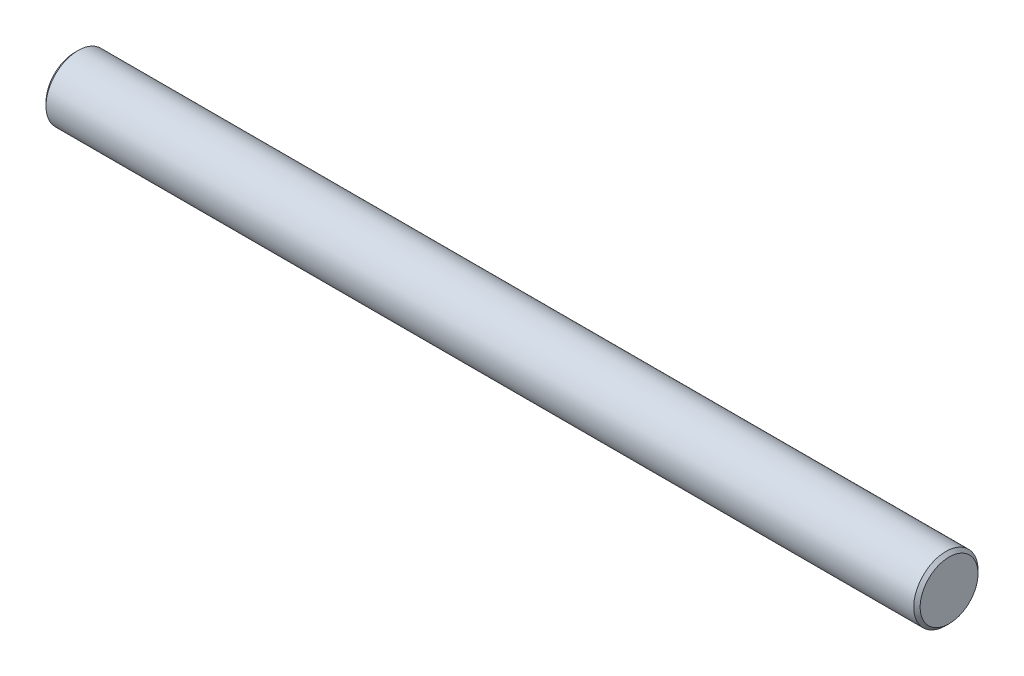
ISO-10303-21;
HEADER;
FILE_DESCRIPTION(('STEP AP214'),'2;1');
FILE_NAME('part.step','',(''),(''),'','','');
FILE_SCHEMA(('AUTOMOTIVE_DESIGN { 1 0 10303 214 1 1 1 1 }'));
ENDSEC;
DATA;
#1=APPLICATION_CONTEXT('core data for automotive mechanical design processes');
#2=APPLICATION_PROTOCOL_DEFINITION('international standard','automotive_design',2000,#1);
#3=PRODUCT_CONTEXT('',#1,'mechanical');
#4=PRODUCT('Part','Part','',(#3));
#5=PRODUCT_RELATED_PRODUCT_CATEGORY('part','',(#4));
#6=PRODUCT_DEFINITION_FORMATION('','',#4);
#7=PRODUCT_DEFINITION_CONTEXT('part definition',#1,'design');
#8=PRODUCT_DEFINITION('design','',#6,#7);
#9=PRODUCT_DEFINITION_SHAPE('','',#8);
#10=(LENGTH_UNIT() NAMED_UNIT(*) SI_UNIT(.MILLI.,.METRE.));
#11=(NAMED_UNIT(*) PLANE_ANGLE_UNIT() SI_UNIT($,.RADIAN.));
#12=(NAMED_UNIT(*) SI_UNIT($,.STERADIAN.) SOLID_ANGLE_UNIT());
#13=UNCERTAINTY_MEASURE_WITH_UNIT(LENGTH_MEASURE(1.E-05),#10,'distance_accuracy_value','');
#14=(GEOMETRIC_REPRESENTATION_CONTEXT(3) GLOBAL_UNCERTAINTY_ASSIGNED_CONTEXT((#13)) GLOBAL_UNIT_ASSIGNED_CONTEXT((#10,
#11,#12)) REPRESENTATION_CONTEXT('',''));
#15=CARTESIAN_POINT('',(0.,0.,0.));
#16=DIRECTION('',(0.,0.,1.));
#17=DIRECTION('',(1.,0.,0.));
#18=AXIS2_PLACEMENT_3D('',#15,#16,#17);
#19=CARTESIAN_POINT('',(272.,0.,0.));
#20=DIRECTION('',(-1.,0.,0.));
#21=DIRECTION('',(0.,0.,1.));
#22=AXIS2_PLACEMENT_3D('',#19,#20,#21);
#23=CYLINDRICAL_SURFACE('',#22,10.);
#24=CARTESIAN_POINT('',(271.,0.,0.));
#25=DIRECTION('',(1.,0.,0.));
#26=DIRECTION('',(0.,0.,-1.));
#27=AXIS2_PLACEMENT_3D('',#24,#25,#26);
#28=CIRCLE('',#27,10.);
#29=CARTESIAN_POINT('',(271.,0.,-10.));
#30=VERTEX_POINT('',#29);
#31=EDGE_CURVE('E9178',#30,#30,#28,.F.);
#32=ORIENTED_EDGE('',*,*,#31,.T.);
#33=EDGE_LOOP('',(#32));
#34=FACE_BOUND('',#33,.T.);
#35=CARTESIAN_POINT('',(1.,0.,0.));
#36=DIRECTION('',(1.,0.,0.));
#37=DIRECTION('',(0.,0.,-1.));
#38=AXIS2_PLACEMENT_3D('',#35,#36,#37);
#39=CIRCLE('',#38,10.);
#40=CARTESIAN_POINT('',(1.,0.,-10.));
#41=VERTEX_POINT('',#40);
#42=EDGE_CURVE('E9182',#41,#41,#39,.T.);
#43=ORIENTED_EDGE('',*,*,#42,.T.);
#44=EDGE_LOOP('',(#43));
#45=FACE_BOUND('',#44,.T.);
#46=ADVANCED_FACE('F9172',(#34,#45),#23,.T.);
#47=CARTESIAN_POINT('',(272.,0.,0.));
#48=DIRECTION('',(1.,0.,0.));
#49=DIRECTION('',(0.,0.,-1.));
#50=AXIS2_PLACEMENT_3D('',#47,#48,#49);
#51=PLANE('',#50);
#52=CARTESIAN_POINT('',(272.,0.,0.));
#53=DIRECTION('',(1.,0.,0.));
#54=DIRECTION('',(0.,0.,-1.));
#55=AXIS2_PLACEMENT_3D('',#52,#53,#54);
#56=CIRCLE('',#55,9.);
#57=CARTESIAN_POINT('',(272.,0.,-9.));
#58=VERTEX_POINT('',#57);
#59=EDGE_CURVE('E9186',#58,#58,#56,.T.);
#60=ORIENTED_EDGE('',*,*,#59,.T.);
#61=EDGE_LOOP('',(#60));
#62=FACE_BOUND('',#61,.T.);
#63=ADVANCED_FACE('F9192',(#62),#51,.T.);
#64=CARTESIAN_POINT('',(0.,0.,0.));
#65=DIRECTION('',(1.,0.,0.));
#66=DIRECTION('',(0.,0.,-1.));
#67=AXIS2_PLACEMENT_3D('',#64,#65,#66);
#68=PLANE('',#67);
#69=CARTESIAN_POINT('',(0.,0.,0.));
#70=DIRECTION('',(1.,0.,0.));
#71=DIRECTION('',(0.,0.,-1.));
#72=AXIS2_PLACEMENT_3D('',#69,#70,#71);
#73=CIRCLE('',#72,8.99999999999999);
#74=CARTESIAN_POINT('',(0.,0.,-8.99999999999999));
#75=VERTEX_POINT('',#74);
#76=EDGE_CURVE('E10',#75,#75,#73,.F.);
#77=ORIENTED_EDGE('',*,*,#76,.T.);
#78=EDGE_LOOP('',(#77));
#79=FACE_BOUND('',#78,.T.);
#80=ADVANCED_FACE('F9197',(#79),#68,.F.);
#81=CARTESIAN_POINT('',(272.,0.,0.));
#82=DIRECTION('',(-1.,0.,0.));
#83=DIRECTION('',(0.,0.,1.));
#84=AXIS2_PLACEMENT_3D('',#81,#82,#83);
#85=CONICAL_SURFACE('',#84,9.,0.785398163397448);
#86=ORIENTED_EDGE('',*,*,#31,.F.);
#87=EDGE_LOOP('',(#86));
#88=FACE_BOUND('',#87,.T.);
#89=ORIENTED_EDGE('',*,*,#59,.F.);
#90=EDGE_LOOP('',(#89));
#91=FACE_BOUND('',#90,.T.);
#92=ADVANCED_FACE('F9194',(#88,#91),#85,.T.);
#93=CARTESIAN_POINT('',(1.,0.,0.));
#94=DIRECTION('',(1.,0.,0.));
#95=DIRECTION('',(0.,0.,-1.));
#96=AXIS2_PLACEMENT_3D('',#93,#94,#95);
#97=CONICAL_SURFACE('',#96,10.,0.785398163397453);
#98=ORIENTED_EDGE('',*,*,#76,.F.);
#99=EDGE_LOOP('',(#98));
#100=FACE_BOUND('',#99,.T.);
#101=ORIENTED_EDGE('',*,*,#42,.F.);
#102=EDGE_LOOP('',(#101));
#103=FACE_BOUND('',#102,.T.);
#104=ADVANCED_FACE('F9196',(#100,#103),#97,.T.);
#105=CLOSED_SHELL('',(#46,#63,#80,#92,#104));
#106=MANIFOLD_SOLID_BREP('B2',#105);
#107=ADVANCED_BREP_SHAPE_REPRESENTATION('',(#18,#106),#14);
#108=SHAPE_DEFINITION_REPRESENTATION(#9,#107);
ENDSEC;
END-ISO-10303-21;
